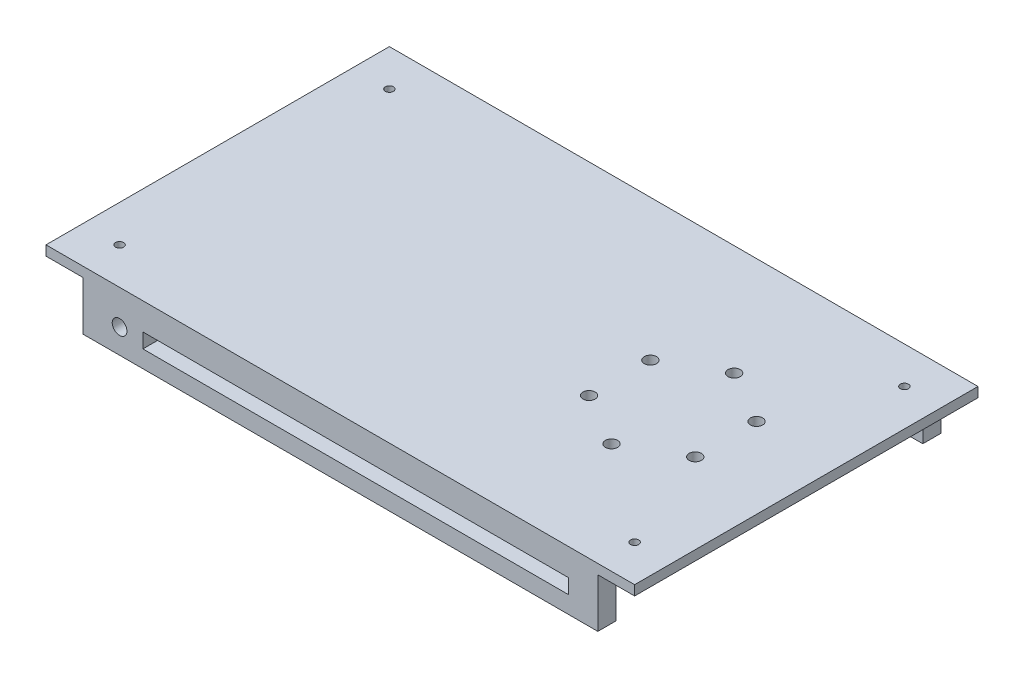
ISO-10303-21;
HEADER;
FILE_DESCRIPTION(('STEP AP214'),'2;1');
FILE_NAME('part.step','',(''),(''),'','','');
FILE_SCHEMA(('AUTOMOTIVE_DESIGN { 1 0 10303 214 1 1 1 1 }'));
ENDSEC;
DATA;
#1=APPLICATION_CONTEXT('core data for automotive mechanical design processes');
#2=APPLICATION_PROTOCOL_DEFINITION('international standard','automotive_design',2000,#1);
#3=PRODUCT_CONTEXT('',#1,'mechanical');
#4=PRODUCT('Part','Part','',(#3));
#5=PRODUCT_RELATED_PRODUCT_CATEGORY('part','',(#4));
#6=PRODUCT_DEFINITION_FORMATION('','',#4);
#7=PRODUCT_DEFINITION_CONTEXT('part definition',#1,'design');
#8=PRODUCT_DEFINITION('design','',#6,#7);
#9=PRODUCT_DEFINITION_SHAPE('','',#8);
#10=(LENGTH_UNIT() NAMED_UNIT(*) SI_UNIT(.MILLI.,.METRE.));
#11=(NAMED_UNIT(*) PLANE_ANGLE_UNIT() SI_UNIT($,.RADIAN.));
#12=(NAMED_UNIT(*) SI_UNIT($,.STERADIAN.) SOLID_ANGLE_UNIT());
#13=UNCERTAINTY_MEASURE_WITH_UNIT(LENGTH_MEASURE(1.E-05),#10,'distance_accuracy_value','');
#14=(GEOMETRIC_REPRESENTATION_CONTEXT(3) GLOBAL_UNCERTAINTY_ASSIGNED_CONTEXT((#13)) GLOBAL_UNIT_ASSIGNED_CONTEXT((#10,
#11,#12)) REPRESENTATION_CONTEXT('',''));
#15=CARTESIAN_POINT('',(0.,0.,0.));
#16=DIRECTION('',(0.,0.,1.));
#17=DIRECTION('',(1.,0.,0.));
#18=AXIS2_PLACEMENT_3D('',#15,#16,#17);
#19=CARTESIAN_POINT('',(210.,-40.,-140.));
#20=DIRECTION('',(1.,0.,0.));
#21=DIRECTION('',(0.,0.,-1.));
#22=AXIS2_PLACEMENT_3D('',#19,#20,#21);
#23=PLANE('',#22);
#24=DIRECTION('',(0.,0.,1.));
#25=VECTOR('',#24,1.);
#26=CARTESIAN_POINT('',(210.,-40.,-140.));
#27=LINE('',#26,#25);
#28=CARTESIAN_POINT('',(210.,-40.,125.));
#29=VERTEX_POINT('',#28);
#30=CARTESIAN_POINT('',(210.,-40.,140.));
#31=VERTEX_POINT('',#30);
#32=EDGE_CURVE('E257',#29,#31,#27,.T.);
#33=ORIENTED_EDGE('',*,*,#32,.F.);
#34=DIRECTION('',(0.,1.,0.));
#35=VECTOR('',#34,1.);
#36=CARTESIAN_POINT('',(210.,-40.,125.));
#37=LINE('',#36,#35);
#38=CARTESIAN_POINT('',(210.,0.,125.));
#39=VERTEX_POINT('',#38);
#40=EDGE_CURVE('E228',#29,#39,#37,.T.);
#41=ORIENTED_EDGE('',*,*,#40,.T.);
#42=DIRECTION('',(0.,0.,1.));
#43=VECTOR('',#42,1.);
#44=CARTESIAN_POINT('',(210.,0.,-140.));
#45=LINE('',#44,#43);
#46=CARTESIAN_POINT('',(210.,0.,140.));
#47=VERTEX_POINT('',#46);
#48=EDGE_CURVE('E245',#39,#47,#45,.T.);
#49=ORIENTED_EDGE('',*,*,#48,.T.);
#50=DIRECTION('',(0.,1.,0.));
#51=VECTOR('',#50,1.);
#52=CARTESIAN_POINT('',(210.,-40.,140.));
#53=LINE('',#52,#51);
#54=EDGE_CURVE('E235',#31,#47,#53,.T.);
#55=ORIENTED_EDGE('',*,*,#54,.F.);
#56=EDGE_LOOP('',(#33,#41,#49,#55));
#57=FACE_BOUND('',#56,.T.);
#58=ADVANCED_FACE('F41',(#57),#23,.T.);
#59=CARTESIAN_POINT('',(-210.,-40.,-140.));
#60=DIRECTION('',(0.,-1.,0.));
#61=DIRECTION('',(0.,0.,-1.));
#62=AXIS2_PLACEMENT_3D('',#59,#60,#61);
#63=PLANE('',#62);
#64=DIRECTION('',(0.,0.,1.));
#65=VECTOR('',#64,1.);
#66=CARTESIAN_POINT('',(-210.,-40.,-140.));
#67=LINE('',#66,#65);
#68=CARTESIAN_POINT('',(-210.,-40.,125.));
#69=VERTEX_POINT('',#68);
#70=CARTESIAN_POINT('',(-210.,-40.,140.));
#71=VERTEX_POINT('',#70);
#72=EDGE_CURVE('E261',#69,#71,#67,.T.);
#73=ORIENTED_EDGE('',*,*,#72,.F.);
#74=DIRECTION('',(1.,0.,0.));
#75=VECTOR('',#74,1.);
#76=CARTESIAN_POINT('',(-210.,-40.,125.));
#77=LINE('',#76,#75);
#78=EDGE_CURVE('E223',#69,#29,#77,.T.);
#79=ORIENTED_EDGE('',*,*,#78,.T.);
#80=ORIENTED_EDGE('',*,*,#32,.T.);
#81=DIRECTION('',(1.,0.,0.));
#82=VECTOR('',#81,1.);
#83=CARTESIAN_POINT('',(-210.,-40.,140.));
#84=LINE('',#83,#82);
#85=EDGE_CURVE('E239',#71,#31,#84,.T.);
#86=ORIENTED_EDGE('',*,*,#85,.F.);
#87=EDGE_LOOP('',(#73,#79,#80,#86));
#88=FACE_BOUND('',#87,.T.);
#89=ADVANCED_FACE('F426',(#88),#63,.T.);
#90=CARTESIAN_POINT('',(-210.,-40.,-140.));
#91=DIRECTION('',(-1.,0.,0.));
#92=DIRECTION('',(0.,0.,1.));
#93=AXIS2_PLACEMENT_3D('',#90,#91,#92);
#94=PLANE('',#93);
#95=DIRECTION('',(0.,0.,1.));
#96=VECTOR('',#95,1.);
#97=CARTESIAN_POINT('',(-210.,0.,-140.));
#98=LINE('',#97,#96);
#99=CARTESIAN_POINT('',(-210.,0.,125.));
#100=VERTEX_POINT('',#99);
#101=CARTESIAN_POINT('',(-210.,0.,140.));
#102=VERTEX_POINT('',#101);
#103=EDGE_CURVE('E265',#100,#102,#98,.T.);
#104=ORIENTED_EDGE('',*,*,#103,.F.);
#105=DIRECTION('',(0.,-1.,0.));
#106=VECTOR('',#105,1.);
#107=CARTESIAN_POINT('',(-210.,-40.,125.));
#108=LINE('',#107,#106);
#109=EDGE_CURVE('E298',#100,#69,#108,.T.);
#110=ORIENTED_EDGE('',*,*,#109,.T.);
#111=ORIENTED_EDGE('',*,*,#72,.T.);
#112=DIRECTION('',(0.,-1.,0.));
#113=VECTOR('',#112,1.);
#114=CARTESIAN_POINT('',(-210.,-40.,140.));
#115=LINE('',#114,#113);
#116=EDGE_CURVE('E248',#102,#71,#115,.T.);
#117=ORIENTED_EDGE('',*,*,#116,.F.);
#118=EDGE_LOOP('',(#104,#110,#111,#117));
#119=FACE_BOUND('',#118,.T.);
#120=ADVANCED_FACE('F434',(#119),#94,.T.);
#121=CARTESIAN_POINT('',(240.,0.,-140.));
#122=DIRECTION('',(1.,0.,0.));
#123=DIRECTION('',(0.,0.,-1.));
#124=AXIS2_PLACEMENT_3D('',#121,#122,#123);
#125=PLANE('',#124);
#126=DIRECTION('',(0.,1.,0.));
#127=VECTOR('',#126,1.);
#128=CARTESIAN_POINT('',(240.,0.,140.));
#129=LINE('',#128,#127);
#130=CARTESIAN_POINT('',(240.,0.,140.));
#131=VERTEX_POINT('',#130);
#132=CARTESIAN_POINT('',(240.,8.,140.));
#133=VERTEX_POINT('',#132);
#134=EDGE_CURVE('E256',#131,#133,#129,.T.);
#135=ORIENTED_EDGE('',*,*,#134,.F.);
#136=DIRECTION('',(0.,0.,1.));
#137=VECTOR('',#136,1.);
#138=CARTESIAN_POINT('',(240.,0.,-140.));
#139=LINE('',#138,#137);
#140=CARTESIAN_POINT('',(240.,0.,-140.));
#141=VERTEX_POINT('',#140);
#142=EDGE_CURVE('E295',#141,#131,#139,.T.);
#143=ORIENTED_EDGE('',*,*,#142,.F.);
#144=DIRECTION('',(0.,1.,0.));
#145=VECTOR('',#144,1.);
#146=CARTESIAN_POINT('',(240.,0.,-140.));
#147=LINE('',#146,#145);
#148=CARTESIAN_POINT('',(240.,8.,-140.));
#149=VERTEX_POINT('',#148);
#150=EDGE_CURVE('E269',#141,#149,#147,.T.);
#151=ORIENTED_EDGE('',*,*,#150,.T.);
#152=DIRECTION('',(0.,0.,1.));
#153=VECTOR('',#152,1.);
#154=CARTESIAN_POINT('',(240.,8.,-140.));
#155=LINE('',#154,#153);
#156=EDGE_CURVE('E283',#149,#133,#155,.T.);
#157=ORIENTED_EDGE('',*,*,#156,.T.);
#158=EDGE_LOOP('',(#135,#143,#151,#157));
#159=FACE_BOUND('',#158,.T.);
#160=ADVANCED_FACE('F43',(#159),#125,.T.);
#161=CARTESIAN_POINT('',(-240.,0.,-140.));
#162=DIRECTION('',(0.,-1.,0.));
#163=DIRECTION('',(0.,0.,-1.));
#164=AXIS2_PLACEMENT_3D('',#161,#162,#163);
#165=PLANE('',#164);
#166=CARTESIAN_POINT('',(174.44759397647,0.,-25.));
#167=DIRECTION('',(0.,-1.,0.));
#168=DIRECTION('',(0.,0.,-1.));
#169=AXIS2_PLACEMENT_3D('',#166,#167,#168);
#170=CIRCLE('',#169,4.99999999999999);
#171=CARTESIAN_POINT('',(174.44759397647,0.,-30.));
#172=VERTEX_POINT('',#171);
#173=EDGE_CURVE('E335',#172,#172,#170,.T.);
#174=ORIENTED_EDGE('',*,*,#173,.F.);
#175=EDGE_LOOP('',(#174));
#176=FACE_BOUND('',#175,.T.);
#177=CARTESIAN_POINT('',(131.146323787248,0.,50.));
#178=DIRECTION('',(0.,-1.,0.));
#179=DIRECTION('',(0.,0.,-1.));
#180=AXIS2_PLACEMENT_3D('',#177,#178,#179);
#181=CIRCLE('',#180,5.00000000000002);
#182=CARTESIAN_POINT('',(131.146323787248,0.,45.));
#183=VERTEX_POINT('',#182);
#184=EDGE_CURVE('E348',#183,#183,#181,.T.);
#185=ORIENTED_EDGE('',*,*,#184,.F.);
#186=EDGE_LOOP('',(#185));
#187=FACE_BOUND('',#186,.T.);
#188=CARTESIAN_POINT('',(174.44759397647,0.,24.9999999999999));
#189=DIRECTION('',(0.,-1.,0.));
#190=DIRECTION('',(0.,0.,-1.));
#191=AXIS2_PLACEMENT_3D('',#188,#189,#190);
#192=CIRCLE('',#191,4.99999999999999);
#193=CARTESIAN_POINT('',(174.44759397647,0.,19.9999999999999));
#194=VERTEX_POINT('',#193);
#195=EDGE_CURVE('E318',#194,#194,#192,.T.);
#196=ORIENTED_EDGE('',*,*,#195,.F.);
#197=EDGE_LOOP('',(#196));
#198=FACE_BOUND('',#197,.T.);
#199=CARTESIAN_POINT('',(131.146323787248,0.,-50.));
#200=DIRECTION('',(0.,-1.,0.));
#201=DIRECTION('',(0.,0.,-1.));
#202=AXIS2_PLACEMENT_3D('',#199,#200,#201);
#203=CIRCLE('',#202,4.99999999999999);
#204=CARTESIAN_POINT('',(131.146323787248,0.,-55.));
#205=VERTEX_POINT('',#204);
#206=EDGE_CURVE('E343',#205,#205,#203,.T.);
#207=ORIENTED_EDGE('',*,*,#206,.F.);
#208=EDGE_LOOP('',(#207));
#209=FACE_BOUND('',#208,.T.);
#210=CARTESIAN_POINT('',(87.8450535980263,0.,-24.9999999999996));
#211=DIRECTION('',(0.,-1.,0.));
#212=DIRECTION('',(0.,0.,-1.));
#213=AXIS2_PLACEMENT_3D('',#210,#211,#212);
#214=CIRCLE('',#213,4.99999999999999);
#215=CARTESIAN_POINT('',(87.8450535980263,0.,-29.9999999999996));
#216=VERTEX_POINT('',#215);
#217=EDGE_CURVE('E339',#216,#216,#214,.T.);
#218=ORIENTED_EDGE('',*,*,#217,.F.);
#219=EDGE_LOOP('',(#218));
#220=FACE_BOUND('',#219,.T.);
#221=CARTESIAN_POINT('',(87.8450535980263,0.,24.9999999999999));
#222=DIRECTION('',(0.,-1.,0.));
#223=DIRECTION('',(0.,0.,-1.));
#224=AXIS2_PLACEMENT_3D('',#221,#222,#223);
#225=CIRCLE('',#224,5.00000000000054);
#226=CARTESIAN_POINT('',(87.8450535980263,0.,19.9999999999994));
#227=VERTEX_POINT('',#226);
#228=EDGE_CURVE('E334',#227,#227,#225,.T.);
#229=ORIENTED_EDGE('',*,*,#228,.F.);
#230=EDGE_LOOP('',(#229));
#231=FACE_BOUND('',#230,.T.);
#232=CARTESIAN_POINT('',(-210.,0.,-110.));
#233=DIRECTION('',(0.,-1.,0.));
#234=DIRECTION('',(0.,0.,-1.));
#235=AXIS2_PLACEMENT_3D('',#232,#233,#234);
#236=CIRCLE('',#235,3.3);
#237=CARTESIAN_POINT('',(-210.,0.,-113.3));
#238=VERTEX_POINT('',#237);
#239=EDGE_CURVE('E330',#238,#238,#236,.T.);
#240=ORIENTED_EDGE('',*,*,#239,.F.);
#241=EDGE_LOOP('',(#240));
#242=FACE_BOUND('',#241,.T.);
#243=CARTESIAN_POINT('',(210.,0.,110.));
#244=DIRECTION('',(0.,-1.,0.));
#245=DIRECTION('',(0.,0.,-1.));
#246=AXIS2_PLACEMENT_3D('',#243,#244,#245);
#247=CIRCLE('',#246,3.3);
#248=CARTESIAN_POINT('',(210.,0.,106.7));
#249=VERTEX_POINT('',#248);
#250=EDGE_CURVE('E326',#249,#249,#247,.T.);
#251=ORIENTED_EDGE('',*,*,#250,.F.);
#252=EDGE_LOOP('',(#251));
#253=FACE_BOUND('',#252,.T.);
#254=CARTESIAN_POINT('',(210.,0.,-110.));
#255=DIRECTION('',(0.,-1.,0.));
#256=DIRECTION('',(0.,0.,-1.));
#257=AXIS2_PLACEMENT_3D('',#254,#255,#256);
#258=CIRCLE('',#257,3.3);
#259=CARTESIAN_POINT('',(210.,0.,-113.3));
#260=VERTEX_POINT('',#259);
#261=EDGE_CURVE('E322',#260,#260,#258,.T.);
#262=ORIENTED_EDGE('',*,*,#261,.F.);
#263=EDGE_LOOP('',(#262));
#264=FACE_BOUND('',#263,.T.);
#265=CARTESIAN_POINT('',(-210.,0.,110.));
#266=DIRECTION('',(0.,-1.,0.));
#267=DIRECTION('',(0.,0.,-1.));
#268=AXIS2_PLACEMENT_3D('',#265,#266,#267);
#269=CIRCLE('',#268,3.3);
#270=CARTESIAN_POINT('',(-210.,0.,106.7));
#271=VERTEX_POINT('',#270);
#272=EDGE_CURVE('E317',#271,#271,#269,.T.);
#273=ORIENTED_EDGE('',*,*,#272,.F.);
#274=EDGE_LOOP('',(#273));
#275=FACE_BOUND('',#274,.T.);
#276=CARTESIAN_POINT('',(-210.,0.,-140.));
#277=VERTEX_POINT('',#276);
#278=CARTESIAN_POINT('',(-210.,0.,-125.));
#279=VERTEX_POINT('',#278);
#280=EDGE_CURVE('E262',#277,#279,#98,.T.);
#281=ORIENTED_EDGE('',*,*,#280,.T.);
#282=DIRECTION('',(-1.,0.,0.));
#283=VECTOR('',#282,1.);
#284=CARTESIAN_POINT('',(-215.,0.,-125.));
#285=LINE('',#284,#283);
#286=CARTESIAN_POINT('',(210.,0.,-125.));
#287=VERTEX_POINT('',#286);
#288=EDGE_CURVE('E221',#287,#279,#285,.T.);
#289=ORIENTED_EDGE('',*,*,#288,.F.);
#290=CARTESIAN_POINT('',(210.,0.,-140.));
#291=VERTEX_POINT('',#290);
#292=EDGE_CURVE('E266',#291,#287,#45,.T.);
#293=ORIENTED_EDGE('',*,*,#292,.F.);
#294=DIRECTION('',(1.,0.,0.));
#295=VECTOR('',#294,1.);
#296=CARTESIAN_POINT('',(-240.,0.,-140.));
#297=LINE('',#296,#295);
#298=EDGE_CURVE('E279',#291,#141,#297,.T.);
#299=ORIENTED_EDGE('',*,*,#298,.T.);
#300=ORIENTED_EDGE('',*,*,#142,.T.);
#301=DIRECTION('',(1.,0.,0.));
#302=VECTOR('',#301,1.);
#303=CARTESIAN_POINT('',(-240.,0.,140.));
#304=LINE('',#303,#302);
#305=EDGE_CURVE('E292',#47,#131,#304,.T.);
#306=ORIENTED_EDGE('',*,*,#305,.F.);
#307=ORIENTED_EDGE('',*,*,#48,.F.);
#308=DIRECTION('',(-1.,0.,0.));
#309=VECTOR('',#308,1.);
#310=CARTESIAN_POINT('',(-215.,0.,125.));
#311=LINE('',#310,#309);
#312=EDGE_CURVE('E220',#39,#100,#311,.T.);
#313=ORIENTED_EDGE('',*,*,#312,.T.);
#314=ORIENTED_EDGE('',*,*,#103,.T.);
#315=CARTESIAN_POINT('',(-240.,0.,140.));
#316=VERTEX_POINT('',#315);
#317=EDGE_CURVE('E273',#316,#102,#304,.T.);
#318=ORIENTED_EDGE('',*,*,#317,.F.);
#319=DIRECTION('',(0.,0.,1.));
#320=VECTOR('',#319,1.);
#321=CARTESIAN_POINT('',(-240.,0.,-140.));
#322=LINE('',#321,#320);
#323=CARTESIAN_POINT('',(-240.,0.,-140.));
#324=VERTEX_POINT('',#323);
#325=EDGE_CURVE('E299',#324,#316,#322,.T.);
#326=ORIENTED_EDGE('',*,*,#325,.F.);
#327=EDGE_CURVE('E280',#324,#277,#297,.T.);
#328=ORIENTED_EDGE('',*,*,#327,.T.);
#329=EDGE_LOOP('',(#281,#289,#293,#299,#300,#306,#307,#313,#314,#318,#326,#328));
#330=FACE_BOUND('',#329,.T.);
#331=ADVANCED_FACE('F466',(#176,#187,#198,#209,#220,#231,#242,#253,#264,#275,#330),#165,.T.);
#332=CARTESIAN_POINT('',(-240.,0.,-140.));
#333=DIRECTION('',(-1.,0.,0.));
#334=DIRECTION('',(0.,0.,1.));
#335=AXIS2_PLACEMENT_3D('',#332,#333,#334);
#336=PLANE('',#335);
#337=DIRECTION('',(0.,-1.,0.));
#338=VECTOR('',#337,1.);
#339=CARTESIAN_POINT('',(-240.,0.,140.));
#340=LINE('',#339,#338);
#341=CARTESIAN_POINT('',(-240.,8.,140.));
#342=VERTEX_POINT('',#341);
#343=EDGE_CURVE('E289',#342,#316,#340,.T.);
#344=ORIENTED_EDGE('',*,*,#343,.F.);
#345=DIRECTION('',(0.,0.,1.));
#346=VECTOR('',#345,1.);
#347=CARTESIAN_POINT('',(-240.,8.,-140.));
#348=LINE('',#347,#346);
#349=CARTESIAN_POINT('',(-240.,8.,-140.));
#350=VERTEX_POINT('',#349);
#351=EDGE_CURVE('E301',#350,#342,#348,.T.);
#352=ORIENTED_EDGE('',*,*,#351,.F.);
#353=DIRECTION('',(0.,-1.,0.));
#354=VECTOR('',#353,1.);
#355=CARTESIAN_POINT('',(-240.,0.,-140.));
#356=LINE('',#355,#354);
#357=EDGE_CURVE('E276',#350,#324,#356,.T.);
#358=ORIENTED_EDGE('',*,*,#357,.T.);
#359=ORIENTED_EDGE('',*,*,#325,.T.);
#360=EDGE_LOOP('',(#344,#352,#358,#359));
#361=FACE_BOUND('',#360,.T.);
#362=ADVANCED_FACE('F495',(#361),#336,.T.);
#363=CARTESIAN_POINT('',(-240.,8.,-140.));
#364=DIRECTION('',(0.,1.,0.));
#365=DIRECTION('',(0.,0.,1.));
#366=AXIS2_PLACEMENT_3D('',#363,#364,#365);
#367=PLANE('',#366);
#368=CARTESIAN_POINT('',(174.44759397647,8.,-25.));
#369=DIRECTION('',(0.,1.,0.));
#370=DIRECTION('',(0.,0.,1.));
#371=AXIS2_PLACEMENT_3D('',#368,#369,#370);
#372=CIRCLE('',#371,4.99999999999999);
#373=CARTESIAN_POINT('',(174.44759397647,8.,-20.));
#374=VERTEX_POINT('',#373);
#375=EDGE_CURVE('E45',#374,#374,#372,.T.);
#376=ORIENTED_EDGE('',*,*,#375,.F.);
#377=EDGE_LOOP('',(#376));
#378=FACE_BOUND('',#377,.T.);
#379=CARTESIAN_POINT('',(131.146323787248,8.,50.));
#380=DIRECTION('',(0.,1.,0.));
#381=DIRECTION('',(0.,0.,1.));
#382=AXIS2_PLACEMENT_3D('',#379,#380,#381);
#383=CIRCLE('',#382,5.00000000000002);
#384=CARTESIAN_POINT('',(131.146323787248,8.,55.));
#385=VERTEX_POINT('',#384);
#386=EDGE_CURVE('E346',#385,#385,#383,.T.);
#387=ORIENTED_EDGE('',*,*,#386,.F.);
#388=EDGE_LOOP('',(#387));
#389=FACE_BOUND('',#388,.T.);
#390=CARTESIAN_POINT('',(174.44759397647,8.,24.9999999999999));
#391=DIRECTION('',(0.,1.,0.));
#392=DIRECTION('',(0.,0.,1.));
#393=AXIS2_PLACEMENT_3D('',#390,#391,#392);
#394=CIRCLE('',#393,4.99999999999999);
#395=CARTESIAN_POINT('',(174.44759397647,8.,29.9999999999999));
#396=VERTEX_POINT('',#395);
#397=EDGE_CURVE('E344',#396,#396,#394,.T.);
#398=ORIENTED_EDGE('',*,*,#397,.F.);
#399=EDGE_LOOP('',(#398));
#400=FACE_BOUND('',#399,.T.);
#401=CARTESIAN_POINT('',(131.146323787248,8.,-50.));
#402=DIRECTION('',(0.,1.,0.));
#403=DIRECTION('',(0.,0.,1.));
#404=AXIS2_PLACEMENT_3D('',#401,#402,#403);
#405=CIRCLE('',#404,4.99999999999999);
#406=CARTESIAN_POINT('',(131.146323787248,8.,-45.));
#407=VERTEX_POINT('',#406);
#408=EDGE_CURVE('E340',#407,#407,#405,.T.);
#409=ORIENTED_EDGE('',*,*,#408,.F.);
#410=EDGE_LOOP('',(#409));
#411=FACE_BOUND('',#410,.T.);
#412=CARTESIAN_POINT('',(87.8450535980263,8.,-24.9999999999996));
#413=DIRECTION('',(0.,1.,0.));
#414=DIRECTION('',(0.,0.,1.));
#415=AXIS2_PLACEMENT_3D('',#412,#413,#414);
#416=CIRCLE('',#415,4.99999999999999);
#417=CARTESIAN_POINT('',(87.8450535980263,8.,-19.9999999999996));
#418=VERTEX_POINT('',#417);
#419=EDGE_CURVE('E336',#418,#418,#416,.T.);
#420=ORIENTED_EDGE('',*,*,#419,.F.);
#421=EDGE_LOOP('',(#420));
#422=FACE_BOUND('',#421,.T.);
#423=CARTESIAN_POINT('',(87.8450535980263,8.,24.9999999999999));
#424=DIRECTION('',(0.,1.,0.));
#425=DIRECTION('',(0.,0.,1.));
#426=AXIS2_PLACEMENT_3D('',#423,#424,#425);
#427=CIRCLE('',#426,5.00000000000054);
#428=CARTESIAN_POINT('',(87.8450535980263,8.,30.0000000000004));
#429=VERTEX_POINT('',#428);
#430=EDGE_CURVE('E331',#429,#429,#427,.T.);
#431=ORIENTED_EDGE('',*,*,#430,.F.);
#432=EDGE_LOOP('',(#431));
#433=FACE_BOUND('',#432,.T.);
#434=CARTESIAN_POINT('',(-210.,8.,-110.));
#435=DIRECTION('',(0.,1.,0.));
#436=DIRECTION('',(0.,0.,1.));
#437=AXIS2_PLACEMENT_3D('',#434,#435,#436);
#438=CIRCLE('',#437,3.3);
#439=CARTESIAN_POINT('',(-210.,8.,-106.7));
#440=VERTEX_POINT('',#439);
#441=EDGE_CURVE('E327',#440,#440,#438,.T.);
#442=ORIENTED_EDGE('',*,*,#441,.F.);
#443=EDGE_LOOP('',(#442));
#444=FACE_BOUND('',#443,.T.);
#445=CARTESIAN_POINT('',(210.,8.,110.));
#446=DIRECTION('',(0.,1.,0.));
#447=DIRECTION('',(0.,0.,1.));
#448=AXIS2_PLACEMENT_3D('',#445,#446,#447);
#449=CIRCLE('',#448,3.3);
#450=CARTESIAN_POINT('',(210.,8.,113.3));
#451=VERTEX_POINT('',#450);
#452=EDGE_CURVE('E323',#451,#451,#449,.T.);
#453=ORIENTED_EDGE('',*,*,#452,.F.);
#454=EDGE_LOOP('',(#453));
#455=FACE_BOUND('',#454,.T.);
#456=CARTESIAN_POINT('',(210.,8.,-110.));
#457=DIRECTION('',(0.,1.,0.));
#458=DIRECTION('',(0.,0.,1.));
#459=AXIS2_PLACEMENT_3D('',#456,#457,#458);
#460=CIRCLE('',#459,3.3);
#461=CARTESIAN_POINT('',(210.,8.,-106.7));
#462=VERTEX_POINT('',#461);
#463=EDGE_CURVE('E319',#462,#462,#460,.T.);
#464=ORIENTED_EDGE('',*,*,#463,.F.);
#465=EDGE_LOOP('',(#464));
#466=FACE_BOUND('',#465,.T.);
#467=CARTESIAN_POINT('',(-210.,8.,110.));
#468=DIRECTION('',(0.,1.,0.));
#469=DIRECTION('',(0.,0.,1.));
#470=AXIS2_PLACEMENT_3D('',#467,#468,#469);
#471=CIRCLE('',#470,3.3);
#472=CARTESIAN_POINT('',(-210.,8.,113.3));
#473=VERTEX_POINT('',#472);
#474=EDGE_CURVE('E314',#473,#473,#471,.T.);
#475=ORIENTED_EDGE('',*,*,#474,.F.);
#476=EDGE_LOOP('',(#475));
#477=FACE_BOUND('',#476,.T.);
#478=DIRECTION('',(-1.,0.,0.));
#479=VECTOR('',#478,1.);
#480=CARTESIAN_POINT('',(-240.,8.,140.));
#481=LINE('',#480,#479);
#482=EDGE_CURVE('E286',#133,#342,#481,.T.);
#483=ORIENTED_EDGE('',*,*,#482,.F.);
#484=ORIENTED_EDGE('',*,*,#156,.F.);
#485=DIRECTION('',(-1.,0.,0.));
#486=VECTOR('',#485,1.);
#487=CARTESIAN_POINT('',(-240.,8.,-140.));
#488=LINE('',#487,#486);
#489=EDGE_CURVE('E272',#149,#350,#488,.T.);
#490=ORIENTED_EDGE('',*,*,#489,.T.);
#491=ORIENTED_EDGE('',*,*,#351,.T.);
#492=EDGE_LOOP('',(#483,#484,#490,#491));
#493=FACE_BOUND('',#492,.T.);
#494=ADVANCED_FACE('F499',(#378,#389,#400,#411,#422,#433,#444,#455,#466,#477,#493),#367,.T.);
#495=CARTESIAN_POINT('',(0.,0.,-140.));
#496=DIRECTION('',(0.,0.,-1.));
#497=DIRECTION('',(-1.,0.,0.));
#498=AXIS2_PLACEMENT_3D('',#495,#496,#497);
#499=PLANE('',#498);
#500=DIRECTION('',(0.,-1.,0.));
#501=VECTOR('',#500,1.);
#502=CARTESIAN_POINT('',(186.,0.,-140.));
#503=LINE('',#502,#501);
#504=CARTESIAN_POINT('',(186.,-14.,-140.));
#505=VERTEX_POINT('',#504);
#506=CARTESIAN_POINT('',(186.,-26.,-140.));
#507=VERTEX_POINT('',#506);
#508=EDGE_CURVE('E191',#505,#507,#503,.T.);
#509=ORIENTED_EDGE('',*,*,#508,.F.);
#510=DIRECTION('',(1.,0.,0.));
#511=VECTOR('',#510,1.);
#512=CARTESIAN_POINT('',(0.,-14.,-140.));
#513=LINE('',#512,#511);
#514=CARTESIAN_POINT('',(-161.,-14.,-140.));
#515=VERTEX_POINT('',#514);
#516=EDGE_CURVE('E177',#515,#505,#513,.T.);
#517=ORIENTED_EDGE('',*,*,#516,.F.);
#518=DIRECTION('',(0.,1.,0.));
#519=VECTOR('',#518,1.);
#520=CARTESIAN_POINT('',(-161.,0.,-140.));
#521=LINE('',#520,#519);
#522=CARTESIAN_POINT('',(-161.,-26.,-140.));
#523=VERTEX_POINT('',#522);
#524=EDGE_CURVE('E394',#523,#515,#521,.T.);
#525=ORIENTED_EDGE('',*,*,#524,.F.);
#526=DIRECTION('',(-1.,0.,0.));
#527=VECTOR('',#526,1.);
#528=CARTESIAN_POINT('',(0.,-26.,-140.));
#529=LINE('',#528,#527);
#530=EDGE_CURVE('E201',#507,#523,#529,.T.);
#531=ORIENTED_EDGE('',*,*,#530,.F.);
#532=EDGE_LOOP('',(#509,#517,#525,#531));
#533=FACE_BOUND('',#532,.T.);
#534=CARTESIAN_POINT('',(-180.,-20.,-140.));
#535=DIRECTION('',(0.,0.,-1.));
#536=DIRECTION('',(-1.,0.,0.));
#537=AXIS2_PLACEMENT_3D('',#534,#535,#536);
#538=CIRCLE('',#537,6.00000000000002);
#539=CARTESIAN_POINT('',(-186.,-20.,-140.));
#540=VERTEX_POINT('',#539);
#541=EDGE_CURVE('E217',#540,#540,#538,.T.);
#542=ORIENTED_EDGE('',*,*,#541,.F.);
#543=EDGE_LOOP('',(#542));
#544=FACE_BOUND('',#543,.T.);
#545=ORIENTED_EDGE('',*,*,#150,.F.);
#546=ORIENTED_EDGE('',*,*,#298,.F.);
#547=DIRECTION('',(0.,1.,0.));
#548=VECTOR('',#547,1.);
#549=CARTESIAN_POINT('',(210.,-40.,-140.));
#550=LINE('',#549,#548);
#551=CARTESIAN_POINT('',(210.,-40.,-140.));
#552=VERTEX_POINT('',#551);
#553=EDGE_CURVE('E236',#552,#291,#550,.T.);
#554=ORIENTED_EDGE('',*,*,#553,.F.);
#555=DIRECTION('',(1.,0.,0.));
#556=VECTOR('',#555,1.);
#557=CARTESIAN_POINT('',(-210.,-40.,-140.));
#558=LINE('',#557,#556);
#559=CARTESIAN_POINT('',(-210.,-40.,-140.));
#560=VERTEX_POINT('',#559);
#561=EDGE_CURVE('E242',#560,#552,#558,.T.);
#562=ORIENTED_EDGE('',*,*,#561,.F.);
#563=DIRECTION('',(0.,-1.,0.));
#564=VECTOR('',#563,1.);
#565=CARTESIAN_POINT('',(-210.,-40.,-140.));
#566=LINE('',#565,#564);
#567=EDGE_CURVE('E238',#277,#560,#566,.T.);
#568=ORIENTED_EDGE('',*,*,#567,.F.);
#569=ORIENTED_EDGE('',*,*,#327,.F.);
#570=ORIENTED_EDGE('',*,*,#357,.F.);
#571=ORIENTED_EDGE('',*,*,#489,.F.);
#572=EDGE_LOOP('',(#545,#546,#554,#562,#568,#569,#570,#571));
#573=FACE_BOUND('',#572,.T.);
#574=ADVANCED_FACE('F199',(#533,#544,#573),#499,.T.);
#575=CARTESIAN_POINT('',(0.,0.,140.));
#576=DIRECTION('',(0.,0.,-1.));
#577=DIRECTION('',(-1.,0.,0.));
#578=AXIS2_PLACEMENT_3D('',#575,#576,#577);
#579=PLANE('',#578);
#580=DIRECTION('',(1.,0.,0.));
#581=VECTOR('',#580,1.);
#582=CARTESIAN_POINT('',(0.,-14.,140.));
#583=LINE('',#582,#581);
#584=CARTESIAN_POINT('',(-161.,-14.,140.));
#585=VERTEX_POINT('',#584);
#586=CARTESIAN_POINT('',(186.,-14.,140.));
#587=VERTEX_POINT('',#586);
#588=EDGE_CURVE('E186',#585,#587,#583,.T.);
#589=ORIENTED_EDGE('',*,*,#588,.T.);
#590=DIRECTION('',(0.,-1.,0.));
#591=VECTOR('',#590,1.);
#592=CARTESIAN_POINT('',(186.,0.,140.));
#593=LINE('',#592,#591);
#594=CARTESIAN_POINT('',(186.,-26.,140.));
#595=VERTEX_POINT('',#594);
#596=EDGE_CURVE('E203',#587,#595,#593,.T.);
#597=ORIENTED_EDGE('',*,*,#596,.T.);
#598=DIRECTION('',(-1.,0.,0.));
#599=VECTOR('',#598,1.);
#600=CARTESIAN_POINT('',(0.,-26.,140.));
#601=LINE('',#600,#599);
#602=CARTESIAN_POINT('',(-161.,-26.,140.));
#603=VERTEX_POINT('',#602);
#604=EDGE_CURVE('E399',#595,#603,#601,.T.);
#605=ORIENTED_EDGE('',*,*,#604,.T.);
#606=DIRECTION('',(0.,1.,0.));
#607=VECTOR('',#606,1.);
#608=CARTESIAN_POINT('',(-161.,0.,140.));
#609=LINE('',#608,#607);
#610=EDGE_CURVE('E391',#603,#585,#609,.T.);
#611=ORIENTED_EDGE('',*,*,#610,.T.);
#612=EDGE_LOOP('',(#589,#597,#605,#611));
#613=FACE_BOUND('',#612,.T.);
#614=CARTESIAN_POINT('',(-180.,-20.,140.));
#615=DIRECTION('',(0.,0.,-1.));
#616=DIRECTION('',(-1.,0.,0.));
#617=AXIS2_PLACEMENT_3D('',#614,#615,#616);
#618=CIRCLE('',#617,6.00000000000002);
#619=CARTESIAN_POINT('',(-186.,-20.,140.));
#620=VERTEX_POINT('',#619);
#621=EDGE_CURVE('E214',#620,#620,#618,.T.);
#622=ORIENTED_EDGE('',*,*,#621,.T.);
#623=EDGE_LOOP('',(#622));
#624=FACE_BOUND('',#623,.T.);
#625=ORIENTED_EDGE('',*,*,#134,.T.);
#626=ORIENTED_EDGE('',*,*,#482,.T.);
#627=ORIENTED_EDGE('',*,*,#343,.T.);
#628=ORIENTED_EDGE('',*,*,#317,.T.);
#629=ORIENTED_EDGE('',*,*,#116,.T.);
#630=ORIENTED_EDGE('',*,*,#85,.T.);
#631=ORIENTED_EDGE('',*,*,#54,.T.);
#632=ORIENTED_EDGE('',*,*,#305,.T.);
#633=EDGE_LOOP('',(#625,#626,#627,#628,#629,#630,#631,#632));
#634=FACE_BOUND('',#633,.T.);
#635=ADVANCED_FACE('F442',(#613,#624,#634),#579,.F.);
#636=DIRECTION('',(0.,1.,0.));
#637=VECTOR('',#636,1.);
#638=CARTESIAN_POINT('',(210.,-40.,-125.));
#639=LINE('',#638,#637);
#640=CARTESIAN_POINT('',(210.,-40.,-125.));
#641=VERTEX_POINT('',#640);
#642=EDGE_CURVE('E233',#641,#287,#639,.T.);
#643=ORIENTED_EDGE('',*,*,#642,.F.);
#644=EDGE_CURVE('E253',#552,#641,#27,.T.);
#645=ORIENTED_EDGE('',*,*,#644,.F.);
#646=ORIENTED_EDGE('',*,*,#553,.T.);
#647=ORIENTED_EDGE('',*,*,#292,.T.);
#648=EDGE_LOOP('',(#643,#645,#646,#647));
#649=FACE_BOUND('',#648,.T.);
#650=ADVANCED_FACE('F429',(#649),#23,.T.);
#651=DIRECTION('',(1.,0.,0.));
#652=VECTOR('',#651,1.);
#653=CARTESIAN_POINT('',(-210.,-40.,-125.));
#654=LINE('',#653,#652);
#655=CARTESIAN_POINT('',(-210.,-40.,-125.));
#656=VERTEX_POINT('',#655);
#657=EDGE_CURVE('E231',#656,#641,#654,.T.);
#658=ORIENTED_EDGE('',*,*,#657,.F.);
#659=EDGE_CURVE('E258',#560,#656,#67,.T.);
#660=ORIENTED_EDGE('',*,*,#659,.F.);
#661=ORIENTED_EDGE('',*,*,#561,.T.);
#662=ORIENTED_EDGE('',*,*,#644,.T.);
#663=EDGE_LOOP('',(#658,#660,#661,#662));
#664=FACE_BOUND('',#663,.T.);
#665=ADVANCED_FACE('F437',(#664),#63,.T.);
#666=DIRECTION('',(0.,-1.,0.));
#667=VECTOR('',#666,1.);
#668=CARTESIAN_POINT('',(-210.,-40.,-125.));
#669=LINE('',#668,#667);
#670=EDGE_CURVE('E306',#279,#656,#669,.T.);
#671=ORIENTED_EDGE('',*,*,#670,.F.);
#672=ORIENTED_EDGE('',*,*,#280,.F.);
#673=ORIENTED_EDGE('',*,*,#567,.T.);
#674=ORIENTED_EDGE('',*,*,#659,.T.);
#675=EDGE_LOOP('',(#671,#672,#673,#674));
#676=FACE_BOUND('',#675,.T.);
#677=ADVANCED_FACE('F448',(#676),#94,.T.);
#678=CARTESIAN_POINT('',(0.,0.,-125.));
#679=DIRECTION('',(0.,0.,-1.));
#680=DIRECTION('',(-1.,0.,0.));
#681=AXIS2_PLACEMENT_3D('',#678,#679,#680);
#682=PLANE('',#681);
#683=DIRECTION('',(1.,0.,0.));
#684=VECTOR('',#683,1.);
#685=CARTESIAN_POINT('',(0.,-14.,-125.));
#686=LINE('',#685,#684);
#687=CARTESIAN_POINT('',(-161.,-14.,-125.));
#688=VERTEX_POINT('',#687);
#689=CARTESIAN_POINT('',(186.,-14.,-125.));
#690=VERTEX_POINT('',#689);
#691=EDGE_CURVE('E385',#688,#690,#686,.T.);
#692=ORIENTED_EDGE('',*,*,#691,.T.);
#693=DIRECTION('',(0.,-1.,0.));
#694=VECTOR('',#693,1.);
#695=CARTESIAN_POINT('',(186.,0.,-125.));
#696=LINE('',#695,#694);
#697=CARTESIAN_POINT('',(186.,-26.,-125.));
#698=VERTEX_POINT('',#697);
#699=EDGE_CURVE('E194',#690,#698,#696,.T.);
#700=ORIENTED_EDGE('',*,*,#699,.T.);
#701=DIRECTION('',(-1.,0.,0.));
#702=VECTOR('',#701,1.);
#703=CARTESIAN_POINT('',(0.,-26.,-125.));
#704=LINE('',#703,#702);
#705=CARTESIAN_POINT('',(-161.,-26.,-125.));
#706=VERTEX_POINT('',#705);
#707=EDGE_CURVE('E396',#698,#706,#704,.T.);
#708=ORIENTED_EDGE('',*,*,#707,.T.);
#709=DIRECTION('',(0.,1.,0.));
#710=VECTOR('',#709,1.);
#711=CARTESIAN_POINT('',(-161.,0.,-125.));
#712=LINE('',#711,#710);
#713=EDGE_CURVE('E185',#706,#688,#712,.T.);
#714=ORIENTED_EDGE('',*,*,#713,.T.);
#715=EDGE_LOOP('',(#692,#700,#708,#714));
#716=FACE_BOUND('',#715,.T.);
#717=CARTESIAN_POINT('',(-180.,-20.,-125.));
#718=DIRECTION('',(0.,0.,-1.));
#719=DIRECTION('',(-1.,0.,0.));
#720=AXIS2_PLACEMENT_3D('',#717,#718,#719);
#721=CIRCLE('',#720,6.00000000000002);
#722=CARTESIAN_POINT('',(-186.,-20.,-125.));
#723=VERTEX_POINT('',#722);
#724=EDGE_CURVE('E206',#723,#723,#721,.T.);
#725=ORIENTED_EDGE('',*,*,#724,.T.);
#726=EDGE_LOOP('',(#725));
#727=FACE_BOUND('',#726,.T.);
#728=ORIENTED_EDGE('',*,*,#642,.T.);
#729=ORIENTED_EDGE('',*,*,#288,.T.);
#730=ORIENTED_EDGE('',*,*,#670,.T.);
#731=ORIENTED_EDGE('',*,*,#657,.T.);
#732=EDGE_LOOP('',(#728,#729,#730,#731));
#733=FACE_BOUND('',#732,.T.);
#734=ADVANCED_FACE('F403',(#716,#727,#733),#682,.F.);
#735=CARTESIAN_POINT('',(0.,0.,125.));
#736=DIRECTION('',(0.,0.,-1.));
#737=DIRECTION('',(-1.,0.,0.));
#738=AXIS2_PLACEMENT_3D('',#735,#736,#737);
#739=PLANE('',#738);
#740=DIRECTION('',(0.,-1.,0.));
#741=VECTOR('',#740,1.);
#742=CARTESIAN_POINT('',(186.,0.,125.));
#743=LINE('',#742,#741);
#744=CARTESIAN_POINT('',(186.,-14.,125.));
#745=VERTEX_POINT('',#744);
#746=CARTESIAN_POINT('',(186.,-26.,125.));
#747=VERTEX_POINT('',#746);
#748=EDGE_CURVE('E11',#745,#747,#743,.T.);
#749=ORIENTED_EDGE('',*,*,#748,.F.);
#750=DIRECTION('',(1.,0.,0.));
#751=VECTOR('',#750,1.);
#752=CARTESIAN_POINT('',(0.,-14.,125.));
#753=LINE('',#752,#751);
#754=CARTESIAN_POINT('',(-161.,-14.,125.));
#755=VERTEX_POINT('',#754);
#756=EDGE_CURVE('E307',#755,#745,#753,.T.);
#757=ORIENTED_EDGE('',*,*,#756,.F.);
#758=DIRECTION('',(0.,1.,0.));
#759=VECTOR('',#758,1.);
#760=CARTESIAN_POINT('',(-161.,0.,125.));
#761=LINE('',#760,#759);
#762=CARTESIAN_POINT('',(-161.,-26.,125.));
#763=VERTEX_POINT('',#762);
#764=EDGE_CURVE('E310',#763,#755,#761,.T.);
#765=ORIENTED_EDGE('',*,*,#764,.F.);
#766=DIRECTION('',(-1.,0.,0.));
#767=VECTOR('',#766,1.);
#768=CARTESIAN_POINT('',(0.,-26.,125.));
#769=LINE('',#768,#767);
#770=EDGE_CURVE('E50',#747,#763,#769,.T.);
#771=ORIENTED_EDGE('',*,*,#770,.F.);
#772=EDGE_LOOP('',(#749,#757,#765,#771));
#773=FACE_BOUND('',#772,.T.);
#774=CARTESIAN_POINT('',(-180.,-20.,125.));
#775=DIRECTION('',(0.,0.,-1.));
#776=DIRECTION('',(-1.,0.,0.));
#777=AXIS2_PLACEMENT_3D('',#774,#775,#776);
#778=CIRCLE('',#777,6.00000000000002);
#779=CARTESIAN_POINT('',(-186.,-20.,125.));
#780=VERTEX_POINT('',#779);
#781=EDGE_CURVE('E202',#780,#780,#778,.T.);
#782=ORIENTED_EDGE('',*,*,#781,.F.);
#783=EDGE_LOOP('',(#782));
#784=FACE_BOUND('',#783,.T.);
#785=ORIENTED_EDGE('',*,*,#78,.F.);
#786=ORIENTED_EDGE('',*,*,#109,.F.);
#787=ORIENTED_EDGE('',*,*,#312,.F.);
#788=ORIENTED_EDGE('',*,*,#40,.F.);
#789=EDGE_LOOP('',(#785,#786,#787,#788));
#790=FACE_BOUND('',#789,.T.);
#791=ADVANCED_FACE('F475',(#773,#784,#790),#739,.T.);
#792=CARTESIAN_POINT('',(-180.,-20.,-500.));
#793=DIRECTION('',(0.,0.,1.));
#794=DIRECTION('',(1.,0.,0.));
#795=AXIS2_PLACEMENT_3D('',#792,#793,#794);
#796=CYLINDRICAL_SURFACE('',#795,6.00000000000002);
#797=ORIENTED_EDGE('',*,*,#781,.T.);
#798=EDGE_LOOP('',(#797));
#799=FACE_BOUND('',#798,.T.);
#800=ORIENTED_EDGE('',*,*,#621,.F.);
#801=EDGE_LOOP('',(#800));
#802=FACE_BOUND('',#801,.T.);
#803=ADVANCED_FACE('F695',(#799,#802),#796,.F.);
#804=ORIENTED_EDGE('',*,*,#541,.T.);
#805=EDGE_LOOP('',(#804));
#806=FACE_BOUND('',#805,.T.);
#807=ORIENTED_EDGE('',*,*,#724,.F.);
#808=EDGE_LOOP('',(#807));
#809=FACE_BOUND('',#808,.T.);
#810=ADVANCED_FACE('F686',(#806,#809),#796,.F.);
#811=CARTESIAN_POINT('',(-161.,-14.,-500.));
#812=DIRECTION('',(0.,1.,0.));
#813=DIRECTION('',(0.,0.,1.));
#814=AXIS2_PLACEMENT_3D('',#811,#812,#813);
#815=PLANE('',#814);
#816=DIRECTION('',(0.,0.,1.));
#817=VECTOR('',#816,1.);
#818=CARTESIAN_POINT('',(-161.,-14.,-500.));
#819=LINE('',#818,#817);
#820=EDGE_CURVE('E196',#755,#585,#819,.T.);
#821=ORIENTED_EDGE('',*,*,#820,.F.);
#822=ORIENTED_EDGE('',*,*,#756,.T.);
#823=DIRECTION('',(0.,0.,1.));
#824=VECTOR('',#823,1.);
#825=CARTESIAN_POINT('',(186.,-14.,-500.));
#826=LINE('',#825,#824);
#827=EDGE_CURVE('E66',#745,#587,#826,.T.);
#828=ORIENTED_EDGE('',*,*,#827,.T.);
#829=ORIENTED_EDGE('',*,*,#588,.F.);
#830=EDGE_LOOP('',(#821,#822,#828,#829));
#831=FACE_BOUND('',#830,.T.);
#832=ADVANCED_FACE('F549',(#831),#815,.F.);
#833=CARTESIAN_POINT('',(-161.,-26.,-500.));
#834=DIRECTION('',(-1.,0.,0.));
#835=DIRECTION('',(0.,0.,1.));
#836=AXIS2_PLACEMENT_3D('',#833,#834,#835);
#837=PLANE('',#836);
#838=DIRECTION('',(0.,0.,1.));
#839=VECTOR('',#838,1.);
#840=CARTESIAN_POINT('',(-161.,-26.,-500.));
#841=LINE('',#840,#839);
#842=EDGE_CURVE('E380',#763,#603,#841,.T.);
#843=ORIENTED_EDGE('',*,*,#842,.F.);
#844=ORIENTED_EDGE('',*,*,#764,.T.);
#845=ORIENTED_EDGE('',*,*,#820,.T.);
#846=ORIENTED_EDGE('',*,*,#610,.F.);
#847=EDGE_LOOP('',(#843,#844,#845,#846));
#848=FACE_BOUND('',#847,.T.);
#849=ADVANCED_FACE('F419',(#848),#837,.F.);
#850=CARTESIAN_POINT('',(-161.,-26.,-500.));
#851=DIRECTION('',(0.,-1.,0.));
#852=DIRECTION('',(0.,0.,-1.));
#853=AXIS2_PLACEMENT_3D('',#850,#851,#852);
#854=PLANE('',#853);
#855=DIRECTION('',(0.,0.,1.));
#856=VECTOR('',#855,1.);
#857=CARTESIAN_POINT('',(186.,-26.,-500.));
#858=LINE('',#857,#856);
#859=EDGE_CURVE('E375',#747,#595,#858,.T.);
#860=ORIENTED_EDGE('',*,*,#859,.F.);
#861=ORIENTED_EDGE('',*,*,#770,.T.);
#862=ORIENTED_EDGE('',*,*,#842,.T.);
#863=ORIENTED_EDGE('',*,*,#604,.F.);
#864=EDGE_LOOP('',(#860,#861,#862,#863));
#865=FACE_BOUND('',#864,.T.);
#866=ADVANCED_FACE('F413',(#865),#854,.F.);
#867=CARTESIAN_POINT('',(186.,-26.,-500.));
#868=DIRECTION('',(1.,0.,0.));
#869=DIRECTION('',(0.,0.,-1.));
#870=AXIS2_PLACEMENT_3D('',#867,#868,#869);
#871=PLANE('',#870);
#872=ORIENTED_EDGE('',*,*,#827,.F.);
#873=ORIENTED_EDGE('',*,*,#748,.T.);
#874=ORIENTED_EDGE('',*,*,#859,.T.);
#875=ORIENTED_EDGE('',*,*,#596,.F.);
#876=EDGE_LOOP('',(#872,#873,#874,#875));
#877=FACE_BOUND('',#876,.T.);
#878=ADVANCED_FACE('F420',(#877),#871,.F.);
#879=ORIENTED_EDGE('',*,*,#508,.T.);
#880=EDGE_CURVE('E378',#507,#698,#858,.T.);
#881=ORIENTED_EDGE('',*,*,#880,.T.);
#882=ORIENTED_EDGE('',*,*,#699,.F.);
#883=EDGE_CURVE('E180',#505,#690,#826,.T.);
#884=ORIENTED_EDGE('',*,*,#883,.F.);
#885=EDGE_LOOP('',(#879,#881,#882,#884));
#886=FACE_BOUND('',#885,.T.);
#887=ADVANCED_FACE('F189',(#886),#871,.F.);
#888=ORIENTED_EDGE('',*,*,#530,.T.);
#889=EDGE_CURVE('E379',#523,#706,#841,.T.);
#890=ORIENTED_EDGE('',*,*,#889,.T.);
#891=ORIENTED_EDGE('',*,*,#707,.F.);
#892=ORIENTED_EDGE('',*,*,#880,.F.);
#893=EDGE_LOOP('',(#888,#890,#891,#892));
#894=FACE_BOUND('',#893,.T.);
#895=ADVANCED_FACE('F410',(#894),#854,.F.);
#896=ORIENTED_EDGE('',*,*,#524,.T.);
#897=EDGE_CURVE('E58',#515,#688,#819,.T.);
#898=ORIENTED_EDGE('',*,*,#897,.T.);
#899=ORIENTED_EDGE('',*,*,#713,.F.);
#900=ORIENTED_EDGE('',*,*,#889,.F.);
#901=EDGE_LOOP('',(#896,#898,#899,#900));
#902=FACE_BOUND('',#901,.T.);
#903=ADVANCED_FACE('F406',(#902),#837,.F.);
#904=ORIENTED_EDGE('',*,*,#516,.T.);
#905=ORIENTED_EDGE('',*,*,#883,.T.);
#906=ORIENTED_EDGE('',*,*,#691,.F.);
#907=ORIENTED_EDGE('',*,*,#897,.F.);
#908=EDGE_LOOP('',(#904,#905,#906,#907));
#909=FACE_BOUND('',#908,.T.);
#910=ADVANCED_FACE('F179',(#909),#815,.F.);
#911=CARTESIAN_POINT('',(-210.,-50.,110.));
#912=DIRECTION('',(0.,1.,0.));
#913=DIRECTION('',(0.,0.,1.));
#914=AXIS2_PLACEMENT_3D('',#911,#912,#913);
#915=CYLINDRICAL_SURFACE('',#914,3.3);
#916=ORIENTED_EDGE('',*,*,#272,.T.);
#917=EDGE_LOOP('',(#916));
#918=FACE_BOUND('',#917,.T.);
#919=ORIENTED_EDGE('',*,*,#474,.T.);
#920=EDGE_LOOP('',(#919));
#921=FACE_BOUND('',#920,.T.);
#922=ADVANCED_FACE('F535',(#918,#921),#915,.F.);
#923=CARTESIAN_POINT('',(210.,-50.,-110.));
#924=DIRECTION('',(0.,1.,0.));
#925=DIRECTION('',(0.,0.,1.));
#926=AXIS2_PLACEMENT_3D('',#923,#924,#925);
#927=CYLINDRICAL_SURFACE('',#926,3.3);
#928=ORIENTED_EDGE('',*,*,#261,.T.);
#929=EDGE_LOOP('',(#928));
#930=FACE_BOUND('',#929,.T.);
#931=ORIENTED_EDGE('',*,*,#463,.T.);
#932=EDGE_LOOP('',(#931));
#933=FACE_BOUND('',#932,.T.);
#934=ADVANCED_FACE('F538',(#930,#933),#927,.F.);
#935=CARTESIAN_POINT('',(210.,-50.,110.));
#936=DIRECTION('',(0.,1.,0.));
#937=DIRECTION('',(0.,0.,1.));
#938=AXIS2_PLACEMENT_3D('',#935,#936,#937);
#939=CYLINDRICAL_SURFACE('',#938,3.3);
#940=ORIENTED_EDGE('',*,*,#250,.T.);
#941=EDGE_LOOP('',(#940));
#942=FACE_BOUND('',#941,.T.);
#943=ORIENTED_EDGE('',*,*,#452,.T.);
#944=EDGE_LOOP('',(#943));
#945=FACE_BOUND('',#944,.T.);
#946=ADVANCED_FACE('F545',(#942,#945),#939,.F.);
#947=CARTESIAN_POINT('',(-210.,-50.,-110.));
#948=DIRECTION('',(0.,1.,0.));
#949=DIRECTION('',(0.,0.,1.));
#950=AXIS2_PLACEMENT_3D('',#947,#948,#949);
#951=CYLINDRICAL_SURFACE('',#950,3.3);
#952=ORIENTED_EDGE('',*,*,#239,.T.);
#953=EDGE_LOOP('',(#952));
#954=FACE_BOUND('',#953,.T.);
#955=ORIENTED_EDGE('',*,*,#441,.T.);
#956=EDGE_LOOP('',(#955));
#957=FACE_BOUND('',#956,.T.);
#958=ADVANCED_FACE('F553',(#954,#957),#951,.F.);
#959=CARTESIAN_POINT('',(87.8450535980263,-50.,24.9999999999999));
#960=DIRECTION('',(0.,1.,0.));
#961=DIRECTION('',(0.,0.,1.));
#962=AXIS2_PLACEMENT_3D('',#959,#960,#961);
#963=CYLINDRICAL_SURFACE('',#962,5.00000000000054);
#964=ORIENTED_EDGE('',*,*,#228,.T.);
#965=EDGE_LOOP('',(#964));
#966=FACE_BOUND('',#965,.T.);
#967=ORIENTED_EDGE('',*,*,#430,.T.);
#968=EDGE_LOOP('',(#967));
#969=FACE_BOUND('',#968,.T.);
#970=ADVANCED_FACE('F556',(#966,#969),#963,.F.);
#971=CARTESIAN_POINT('',(87.8450535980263,-50.,-24.9999999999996));
#972=DIRECTION('',(0.,1.,0.));
#973=DIRECTION('',(0.,0.,1.));
#974=AXIS2_PLACEMENT_3D('',#971,#972,#973);
#975=CYLINDRICAL_SURFACE('',#974,4.99999999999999);
#976=ORIENTED_EDGE('',*,*,#217,.T.);
#977=EDGE_LOOP('',(#976));
#978=FACE_BOUND('',#977,.T.);
#979=ORIENTED_EDGE('',*,*,#419,.T.);
#980=EDGE_LOOP('',(#979));
#981=FACE_BOUND('',#980,.T.);
#982=ADVANCED_FACE('F561',(#978,#981),#975,.F.);
#983=CARTESIAN_POINT('',(131.146323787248,-50.,-50.));
#984=DIRECTION('',(0.,1.,0.));
#985=DIRECTION('',(0.,0.,1.));
#986=AXIS2_PLACEMENT_3D('',#983,#984,#985);
#987=CYLINDRICAL_SURFACE('',#986,4.99999999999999);
#988=ORIENTED_EDGE('',*,*,#206,.T.);
#989=EDGE_LOOP('',(#988));
#990=FACE_BOUND('',#989,.T.);
#991=ORIENTED_EDGE('',*,*,#408,.T.);
#992=EDGE_LOOP('',(#991));
#993=FACE_BOUND('',#992,.T.);
#994=ADVANCED_FACE('F565',(#990,#993),#987,.F.);
#995=CARTESIAN_POINT('',(174.44759397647,-50.,24.9999999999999));
#996=DIRECTION('',(0.,1.,0.));
#997=DIRECTION('',(0.,0.,1.));
#998=AXIS2_PLACEMENT_3D('',#995,#996,#997);
#999=CYLINDRICAL_SURFACE('',#998,4.99999999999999);
#1000=ORIENTED_EDGE('',*,*,#195,.T.);
#1001=EDGE_LOOP('',(#1000));
#1002=FACE_BOUND('',#1001,.T.);
#1003=ORIENTED_EDGE('',*,*,#397,.T.);
#1004=EDGE_LOOP('',(#1003));
#1005=FACE_BOUND('',#1004,.T.);
#1006=ADVANCED_FACE('F569',(#1002,#1005),#999,.F.);
#1007=CARTESIAN_POINT('',(131.146323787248,-50.,50.));
#1008=DIRECTION('',(0.,1.,0.));
#1009=DIRECTION('',(0.,0.,1.));
#1010=AXIS2_PLACEMENT_3D('',#1007,#1008,#1009);
#1011=CYLINDRICAL_SURFACE('',#1010,5.00000000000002);
#1012=ORIENTED_EDGE('',*,*,#184,.T.);
#1013=EDGE_LOOP('',(#1012));
#1014=FACE_BOUND('',#1013,.T.);
#1015=ORIENTED_EDGE('',*,*,#386,.T.);
#1016=EDGE_LOOP('',(#1015));
#1017=FACE_BOUND('',#1016,.T.);
#1018=ADVANCED_FACE('F572',(#1014,#1017),#1011,.F.);
#1019=CARTESIAN_POINT('',(174.44759397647,-50.,-25.));
#1020=DIRECTION('',(0.,1.,0.));
#1021=DIRECTION('',(0.,0.,1.));
#1022=AXIS2_PLACEMENT_3D('',#1019,#1020,#1021);
#1023=CYLINDRICAL_SURFACE('',#1022,4.99999999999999);
#1024=ORIENTED_EDGE('',*,*,#173,.T.);
#1025=EDGE_LOOP('',(#1024));
#1026=FACE_BOUND('',#1025,.T.);
#1027=ORIENTED_EDGE('',*,*,#375,.T.);
#1028=EDGE_LOOP('',(#1027));
#1029=FACE_BOUND('',#1028,.T.);
#1030=ADVANCED_FACE('F575',(#1026,#1029),#1023,.F.);
#1031=CLOSED_SHELL('',(#58,#89,#120,#160,#331,#362,#494,#574,#635,#650,#665,#677,#734,#791,#803,
#810,#832,#849,#866,#878,#887,#895,#903,#910,#922,#934,#946,#958,#970,#982,#994,#1006,#1018,#1030));
#1032=MANIFOLD_SOLID_BREP('B2',#1031);
#1033=ADVANCED_BREP_SHAPE_REPRESENTATION('',(#18,#1032),#14);
#1034=SHAPE_DEFINITION_REPRESENTATION(#9,#1033);
ENDSEC;
END-ISO-10303-21;
